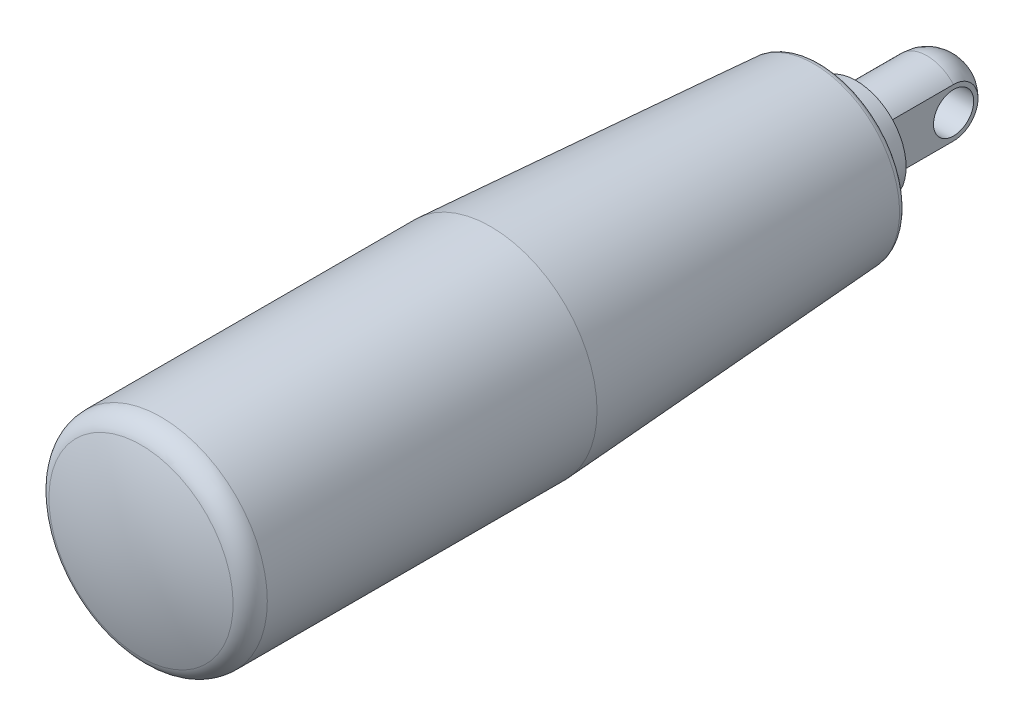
ISO-10303-21;
HEADER;
FILE_DESCRIPTION(('STEP AP214'),'2;1');
FILE_NAME('part.step','',(''),(''),'','','');
FILE_SCHEMA(('AUTOMOTIVE_DESIGN { 1 0 10303 214 1 1 1 1 }'));
ENDSEC;
DATA;
#1=APPLICATION_CONTEXT('core data for automotive mechanical design processes');
#2=APPLICATION_PROTOCOL_DEFINITION('international standard','automotive_design',2000,#1);
#3=PRODUCT_CONTEXT('',#1,'mechanical');
#4=PRODUCT('Part','Part','',(#3));
#5=PRODUCT_RELATED_PRODUCT_CATEGORY('part','',(#4));
#6=PRODUCT_DEFINITION_FORMATION('','',#4);
#7=PRODUCT_DEFINITION_CONTEXT('part definition',#1,'design');
#8=PRODUCT_DEFINITION('design','',#6,#7);
#9=PRODUCT_DEFINITION_SHAPE('','',#8);
#10=(LENGTH_UNIT() NAMED_UNIT(*) SI_UNIT(.MILLI.,.METRE.));
#11=(NAMED_UNIT(*) PLANE_ANGLE_UNIT() SI_UNIT($,.RADIAN.));
#12=(NAMED_UNIT(*) SI_UNIT($,.STERADIAN.) SOLID_ANGLE_UNIT());
#13=UNCERTAINTY_MEASURE_WITH_UNIT(LENGTH_MEASURE(1.E-05),#10,'distance_accuracy_value','');
#14=(GEOMETRIC_REPRESENTATION_CONTEXT(3) GLOBAL_UNCERTAINTY_ASSIGNED_CONTEXT((#13)) GLOBAL_UNIT_ASSIGNED_CONTEXT((#10,
#11,#12)) REPRESENTATION_CONTEXT('',''));
#15=CARTESIAN_POINT('',(0.,0.,0.));
#16=DIRECTION('',(0.,0.,1.));
#17=DIRECTION('',(1.,0.,0.));
#18=AXIS2_PLACEMENT_3D('',#15,#16,#17);
#19=CARTESIAN_POINT('',(26.,0.,0.));
#20=DIRECTION('',(1.,0.,0.));
#21=DIRECTION('',(0.,1.,0.));
#22=AXIS2_PLACEMENT_3D('',#19,#20,#21);
#23=CYLINDRICAL_SURFACE('',#22,2.6);
#24=CARTESIAN_POINT('',(-3.4375,0.,0.));
#25=DIRECTION('',(1.,0.,0.));
#26=DIRECTION('',(0.,1.,0.));
#27=AXIS2_PLACEMENT_3D('',#24,#25,#26);
#28=CIRCLE('',#27,2.6);
#29=CARTESIAN_POINT('',(-3.4375,2.6,0.));
#30=VERTEX_POINT('',#29);
#31=EDGE_CURVE('E86',#30,#30,#28,.F.);
#32=ORIENTED_EDGE('',*,*,#31,.T.);
#33=EDGE_LOOP('',(#32));
#34=FACE_BOUND('',#33,.T.);
#35=CARTESIAN_POINT('',(3.4375,0.,0.));
#36=DIRECTION('',(1.,0.,0.));
#37=DIRECTION('',(0.,1.,0.));
#38=AXIS2_PLACEMENT_3D('',#35,#36,#37);
#39=CIRCLE('',#38,2.6);
#40=CARTESIAN_POINT('',(3.4375,2.6,0.));
#41=VERTEX_POINT('',#40);
#42=EDGE_CURVE('E19',#41,#41,#39,.F.);
#43=ORIENTED_EDGE('',*,*,#42,.F.);
#44=EDGE_LOOP('',(#43));
#45=FACE_BOUND('',#44,.T.);
#46=ADVANCED_FACE('F14',(#34,#45),#23,.F.);
#47=CARTESIAN_POINT('',(0.0100000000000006,0.,0.00999999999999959));
#48=DIRECTION('',(0.,-1.,0.));
#49=DIRECTION('',(1.,0.,0.));
#50=AXIS2_PLACEMENT_3D('',#47,#48,#49);
#51=CIRCLE('',#50,4.665);
#52=TRIMMED_CURVE('',#51,(PARAMETER_VALUE(-1.572939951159)),(PARAMETER_VALUE(1.572939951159)),
.T.,.PARAMETER.);
#53=CARTESIAN_POINT('',(0.,0.,0.00999999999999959));
#54=DIRECTION('',(0.,0.,1.));
#55=AXIS1_PLACEMENT('',#53,#54);
#56=SURFACE_OF_REVOLUTION('',#52,#55);
#57=CARTESIAN_POINT('',(0.,0.,-4.65498928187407));
#58=VERTEX_POINT('',#57);
#59=VERTEX_LOOP('',#58);
#60=FACE_BOUND('',#59,.T.);
#61=CARTESIAN_POINT('',(0.,0.,0.00999999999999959));
#62=DIRECTION('',(0.,0.,-1.));
#63=DIRECTION('',(0.,1.,0.));
#64=AXIS2_PLACEMENT_3D('',#61,#62,#63);
#65=CIRCLE('',#64,4.675);
#66=CARTESIAN_POINT('',(3.4375,3.1684726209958,0.00999999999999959));
#67=VERTEX_POINT('',#66);
#68=CARTESIAN_POINT('',(-3.4375,3.1684726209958,0.00999999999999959));
#69=VERTEX_POINT('',#68);
#70=EDGE_CURVE('E64',#67,#69,#65,.F.);
#71=ORIENTED_EDGE('',*,*,#70,.F.);
#72=CARTESIAN_POINT('',(3.4375,-3.1684726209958,0.00999999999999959));
#73=CARTESIAN_POINT('',(3.4375,-3.16847205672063,-0.0789879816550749));
#74=CARTESIAN_POINT('',(3.4375,-3.16471332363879,-0.167933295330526));
#75=CARTESIAN_POINT('',(3.4375,-3.14971841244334,-0.345186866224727));
#76=CARTESIAN_POINT('',(3.4375,-3.13848260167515,-0.433495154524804));
#77=CARTESIAN_POINT('',(3.4375,-3.09366567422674,-0.696366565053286));
#78=CARTESIAN_POINT('',(3.4375,-3.04897477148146,-0.869167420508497));
#79=CARTESIAN_POINT('',(3.4375,-2.93121313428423,-1.20480179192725));
#80=CARTESIAN_POINT('',(3.4375,-2.85812938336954,-1.36763069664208));
#81=CARTESIAN_POINT('',(3.4375,-2.68567390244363,-1.6787008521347));
#82=CARTESIAN_POINT('',(3.4375,-2.58630725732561,-1.8269449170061));
#83=CARTESIAN_POINT('',(3.4375,-2.36410034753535,-2.10466404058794));
#84=CARTESIAN_POINT('',(3.4375,-2.24125795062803,-2.23413739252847));
#85=CARTESIAN_POINT('',(3.4375,-1.97557835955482,-2.47066675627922));
#86=CARTESIAN_POINT('',(3.4375,-1.83273807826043,-2.57771930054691));
#87=CARTESIAN_POINT('',(3.4375,-1.53100283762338,-2.76644637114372));
#88=CARTESIAN_POINT('',(3.4375,-1.37209402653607,-2.84809875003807));
#89=CARTESIAN_POINT('',(3.4375,-1.04284700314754,-2.98360246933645));
#90=CARTESIAN_POINT('',(3.4375,-0.872509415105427,-3.03745532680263));
#91=CARTESIAN_POINT('',(3.4375,-0.524979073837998,-3.11591691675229));
#92=CARTESIAN_POINT('',(3.4375,-0.347777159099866,-3.1404850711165));
#93=CARTESIAN_POINT('',(3.4375,0.00824193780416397,-3.15955654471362));
#94=CARTESIAN_POINT('',(3.4375,0.187059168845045,-3.15405895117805));
#95=CARTESIAN_POINT('',(3.4375,0.541412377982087,-3.11312990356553));
#96=CARTESIAN_POINT('',(3.4375,0.716944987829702,-3.07766927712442));
#97=CARTESIAN_POINT('',(3.4375,1.05955995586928,-2.97776798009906));
#98=CARTESIAN_POINT('',(3.4375,1.22664236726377,-2.91332749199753));
#99=CARTESIAN_POINT('',(3.4375,1.5475261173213,-2.75731471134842));
#100=CARTESIAN_POINT('',(3.4375,1.70133348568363,-2.66575482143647));
#101=CARTESIAN_POINT('',(3.4375,1.99135770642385,-2.45808271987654));
#102=CARTESIAN_POINT('',(3.4375,2.12757553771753,-2.34197187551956));
#103=CARTESIAN_POINT('',(3.4375,2.37834859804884,-2.08868247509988));
#104=CARTESIAN_POINT('',(3.4375,2.49293603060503,-1.9515357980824));
#105=CARTESIAN_POINT('',(3.4375,2.69746535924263,-1.65987987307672));
#106=CARTESIAN_POINT('',(3.4375,2.78739953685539,-1.50536520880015));
#107=CARTESIAN_POINT('',(3.4375,2.93996371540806,-1.18352917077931));
#108=CARTESIAN_POINT('',(3.4375,3.00260765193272,-1.01621438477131));
#109=CARTESIAN_POINT('',(3.4375,3.09880144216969,-0.673569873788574));
#110=CARTESIAN_POINT('',(3.4375,3.13239594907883,-0.498252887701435));
#111=CARTESIAN_POINT('',(3.4375,3.15685169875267,-0.266476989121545));
#112=CARTESIAN_POINT('',(3.4375,3.1612118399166,-0.211222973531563));
#113=CARTESIAN_POINT('',(3.4375,3.1670183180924,-0.100653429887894));
#114=CARTESIAN_POINT('',(3.4375,3.16846945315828,-0.0453381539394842));
#115=CARTESIAN_POINT('',(3.4375,3.1684726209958,0.00999999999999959));
#116=B_SPLINE_CURVE_WITH_KNOTS('',3,(#72,#73,#74,#75,#76,#77,#78,#79,#80,#81,#82,#83,#84,#85,
#86,#87,#88,#89,#90,#91,#92,#93,#94,#95,#96,#97,#98,#99,#100,#101,#102,#103,#104,#105,#106,#107,
#108,#109,#110,#111,#112,#113,#114,#115),.UNSPECIFIED.,.F.,.F.,(4,2,2,2,2,2,2,2,2,2,2,2,2,2,2,2,
2,2,2,2,2,4),(0.,0.266799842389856,0.533586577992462,1.06629761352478,1.59925315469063,
2.13210566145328,2.66500658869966,3.19798987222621,3.73143659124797,4.26485419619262,
4.79901007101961,5.3331821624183,5.8678749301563,6.40256433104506,6.93700957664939,
7.47142506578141,8.00503852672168,8.53881886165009,9.07232630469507,9.60501220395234,
9.77123628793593,9.93718597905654),.UNSPECIFIED.);
#117=CARTESIAN_POINT('',(3.4375,-3.1684726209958,0.00999999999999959));
#118=VERTEX_POINT('',#117);
#119=EDGE_CURVE('E57',#118,#67,#116,.T.);
#120=ORIENTED_EDGE('',*,*,#119,.F.);
#121=CARTESIAN_POINT('',(0.,0.,0.00999999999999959));
#122=DIRECTION('',(0.,0.,-1.));
#123=DIRECTION('',(0.,1.,0.));
#124=AXIS2_PLACEMENT_3D('',#121,#122,#123);
#125=CIRCLE('',#124,4.675);
#126=CARTESIAN_POINT('',(-3.4375,-3.1684726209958,0.00999999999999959));
#127=VERTEX_POINT('',#126);
#128=EDGE_CURVE('E89',#127,#118,#125,.F.);
#129=ORIENTED_EDGE('',*,*,#128,.F.);
#130=CARTESIAN_POINT('',(-3.4375,-3.1684726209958,0.00999999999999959));
#131=CARTESIAN_POINT('',(-3.4375,-3.16847205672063,-0.078987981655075));
#132=CARTESIAN_POINT('',(-3.4375,-3.16471332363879,-0.167933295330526));
#133=CARTESIAN_POINT('',(-3.4375,-3.14971841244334,-0.345186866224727));
#134=CARTESIAN_POINT('',(-3.4375,-3.13848260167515,-0.433495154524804));
#135=CARTESIAN_POINT('',(-3.4375,-3.09366567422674,-0.696366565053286));
#136=CARTESIAN_POINT('',(-3.4375,-3.04897477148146,-0.869167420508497));
#137=CARTESIAN_POINT('',(-3.4375,-2.93121313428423,-1.20480179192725));
#138=CARTESIAN_POINT('',(-3.4375,-2.85812938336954,-1.36763069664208));
#139=CARTESIAN_POINT('',(-3.4375,-2.68567390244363,-1.6787008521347));
#140=CARTESIAN_POINT('',(-3.4375,-2.58630725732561,-1.8269449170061));
#141=CARTESIAN_POINT('',(-3.4375,-2.36410034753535,-2.10466404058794));
#142=CARTESIAN_POINT('',(-3.4375,-2.24125795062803,-2.23413739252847));
#143=CARTESIAN_POINT('',(-3.4375,-1.97557835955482,-2.47066675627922));
#144=CARTESIAN_POINT('',(-3.4375,-1.83273807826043,-2.57771930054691));
#145=CARTESIAN_POINT('',(-3.4375,-1.53100283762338,-2.76644637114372));
#146=CARTESIAN_POINT('',(-3.4375,-1.37209402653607,-2.84809875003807));
#147=CARTESIAN_POINT('',(-3.4375,-1.04284700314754,-2.98360246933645));
#148=CARTESIAN_POINT('',(-3.4375,-0.872509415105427,-3.03745532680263));
#149=CARTESIAN_POINT('',(-3.4375,-0.524979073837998,-3.11591691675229));
#150=CARTESIAN_POINT('',(-3.4375,-0.347777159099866,-3.1404850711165));
#151=CARTESIAN_POINT('',(-3.4375,0.00824193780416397,-3.15955654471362));
#152=CARTESIAN_POINT('',(-3.4375,0.187059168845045,-3.15405895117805));
#153=CARTESIAN_POINT('',(-3.4375,0.541412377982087,-3.11312990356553));
#154=CARTESIAN_POINT('',(-3.4375,0.716944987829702,-3.07766927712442));
#155=CARTESIAN_POINT('',(-3.4375,1.05955995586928,-2.97776798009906));
#156=CARTESIAN_POINT('',(-3.4375,1.22664236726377,-2.91332749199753));
#157=CARTESIAN_POINT('',(-3.4375,1.5475261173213,-2.75731471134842));
#158=CARTESIAN_POINT('',(-3.4375,1.70133348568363,-2.66575482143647));
#159=CARTESIAN_POINT('',(-3.4375,1.99135770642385,-2.45808271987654));
#160=CARTESIAN_POINT('',(-3.4375,2.12757553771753,-2.34197187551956));
#161=CARTESIAN_POINT('',(-3.4375,2.37834859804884,-2.08868247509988));
#162=CARTESIAN_POINT('',(-3.4375,2.49293603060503,-1.9515357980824));
#163=CARTESIAN_POINT('',(-3.4375,2.69746535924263,-1.65987987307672));
#164=CARTESIAN_POINT('',(-3.4375,2.78739953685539,-1.50536520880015));
#165=CARTESIAN_POINT('',(-3.4375,2.93996371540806,-1.18352917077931));
#166=CARTESIAN_POINT('',(-3.4375,3.00260765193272,-1.01621438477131));
#167=CARTESIAN_POINT('',(-3.4375,3.09880144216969,-0.673569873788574));
#168=CARTESIAN_POINT('',(-3.4375,3.13239594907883,-0.498252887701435));
#169=CARTESIAN_POINT('',(-3.4375,3.15685169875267,-0.266476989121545));
#170=CARTESIAN_POINT('',(-3.4375,3.1612118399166,-0.211222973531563));
#171=CARTESIAN_POINT('',(-3.4375,3.1670183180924,-0.100653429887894));
#172=CARTESIAN_POINT('',(-3.4375,3.16846945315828,-0.0453381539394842));
#173=CARTESIAN_POINT('',(-3.4375,3.1684726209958,0.00999999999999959));
#174=B_SPLINE_CURVE_WITH_KNOTS('',3,(#130,#131,#132,#133,#134,#135,#136,#137,#138,#139,#140,
#141,#142,#143,#144,#145,#146,#147,#148,#149,#150,#151,#152,#153,#154,#155,#156,#157,#158,#159,
#160,#161,#162,#163,#164,#165,#166,#167,#168,#169,#170,#171,#172,#173),.UNSPECIFIED.,.F.,.F.,(4,
2,2,2,2,2,2,2,2,2,2,2,2,2,2,2,2,2,2,2,2,4),(0.,0.266799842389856,0.533586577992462,
1.06629761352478,1.59925315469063,2.13210566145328,2.66500658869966,3.19798987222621,
3.73143659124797,4.26485419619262,4.79901007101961,5.3331821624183,5.8678749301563,
6.40256433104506,6.93700957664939,7.47142506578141,8.00503852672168,8.53881886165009,
9.07232630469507,9.60501220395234,9.77123628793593,9.93718597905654),.UNSPECIFIED.);
#175=EDGE_CURVE('E67',#127,#69,#174,.T.);
#176=ORIENTED_EDGE('',*,*,#175,.T.);
#177=EDGE_LOOP('',(#71,#120,#129,#176));
#178=FACE_BOUND('',#177,.T.);
#179=ADVANCED_FACE('F16',(#60,#178),#56,.T.);
#180=CARTESIAN_POINT('',(3.4375,0.,-9.25));
#181=DIRECTION('',(1.,0.,0.));
#182=DIRECTION('',(0.,1.,0.));
#183=AXIS2_PLACEMENT_3D('',#180,#181,#182);
#184=PLANE('',#183);
#185=DIRECTION('',(0.,0.,-1.));
#186=VECTOR('',#185,1.);
#187=CARTESIAN_POINT('',(3.4375,-3.1684726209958,-4.65498928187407));
#188=LINE('',#187,#186);
#189=CARTESIAN_POINT('',(3.4375,-3.1684726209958,9.15));
#190=VERTEX_POINT('',#189);
#191=EDGE_CURVE('E87',#118,#190,#188,.F.);
#192=ORIENTED_EDGE('',*,*,#191,.F.);
#193=ORIENTED_EDGE('',*,*,#119,.T.);
#194=DIRECTION('',(0.,0.,-1.));
#195=VECTOR('',#194,1.);
#196=CARTESIAN_POINT('',(3.4375,3.1684726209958,-4.65498928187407));
#197=LINE('',#196,#195);
#198=CARTESIAN_POINT('',(3.4375,3.1684726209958,9.15));
#199=VERTEX_POINT('',#198);
#200=EDGE_CURVE('E70',#199,#67,#197,.T.);
#201=ORIENTED_EDGE('',*,*,#200,.F.);
#202=DIRECTION('',(0.,-1.,0.));
#203=VECTOR('',#202,1.);
#204=CARTESIAN_POINT('',(3.4375,0.,9.15));
#205=LINE('',#204,#203);
#206=EDGE_CURVE('E69',#199,#190,#205,.T.);
#207=ORIENTED_EDGE('',*,*,#206,.T.);
#208=EDGE_LOOP('',(#192,#193,#201,#207));
#209=FACE_BOUND('',#208,.T.);
#210=ORIENTED_EDGE('',*,*,#42,.T.);
#211=EDGE_LOOP('',(#210));
#212=FACE_BOUND('',#211,.T.);
#213=ADVANCED_FACE('F62',(#209,#212),#184,.T.);
#214=CARTESIAN_POINT('',(0.,0.,-4.65498928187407));
#215=DIRECTION('',(0.,0.,-1.));
#216=DIRECTION('',(0.,1.,0.));
#217=AXIS2_PLACEMENT_3D('',#214,#215,#216);
#218=CYLINDRICAL_SURFACE('',#217,4.675);
#219=ORIENTED_EDGE('',*,*,#128,.T.);
#220=ORIENTED_EDGE('',*,*,#191,.T.);
#221=CARTESIAN_POINT('',(0.,0.,9.15));
#222=DIRECTION('',(0.,0.,-1.));
#223=DIRECTION('',(0.,1.,0.));
#224=AXIS2_PLACEMENT_3D('',#221,#222,#223);
#225=CIRCLE('',#224,4.675);
#226=CARTESIAN_POINT('',(-3.4375,-3.1684726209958,9.15));
#227=VERTEX_POINT('',#226);
#228=EDGE_CURVE('E111',#190,#227,#225,.T.);
#229=ORIENTED_EDGE('',*,*,#228,.T.);
#230=DIRECTION('',(0.,0.,1.));
#231=VECTOR('',#230,1.);
#232=CARTESIAN_POINT('',(-3.4375,-3.1684726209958,-9.25));
#233=LINE('',#232,#231);
#234=EDGE_CURVE('E83',#227,#127,#233,.F.);
#235=ORIENTED_EDGE('',*,*,#234,.T.);
#236=EDGE_LOOP('',(#219,#220,#229,#235));
#237=FACE_BOUND('',#236,.T.);
#238=ADVANCED_FACE('F124',(#237),#218,.T.);
#239=CARTESIAN_POINT('',(-3.4375,0.,-9.25));
#240=DIRECTION('',(1.,0.,0.));
#241=DIRECTION('',(0.,1.,0.));
#242=AXIS2_PLACEMENT_3D('',#239,#240,#241);
#243=PLANE('',#242);
#244=DIRECTION('',(0.,0.,-1.));
#245=VECTOR('',#244,1.);
#246=CARTESIAN_POINT('',(-3.4375,3.1684726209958,-4.65498928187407));
#247=LINE('',#246,#245);
#248=CARTESIAN_POINT('',(-3.4375,3.1684726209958,9.15));
#249=VERTEX_POINT('',#248);
#250=EDGE_CURVE('E78',#69,#249,#247,.F.);
#251=ORIENTED_EDGE('',*,*,#250,.F.);
#252=ORIENTED_EDGE('',*,*,#175,.F.);
#253=ORIENTED_EDGE('',*,*,#234,.F.);
#254=DIRECTION('',(0.,-1.,0.));
#255=VECTOR('',#254,1.);
#256=CARTESIAN_POINT('',(-3.4375,0.,9.15));
#257=LINE('',#256,#255);
#258=EDGE_CURVE('E34',#227,#249,#257,.F.);
#259=ORIENTED_EDGE('',*,*,#258,.T.);
#260=EDGE_LOOP('',(#251,#252,#253,#259));
#261=FACE_BOUND('',#260,.T.);
#262=ORIENTED_EDGE('',*,*,#31,.F.);
#263=EDGE_LOOP('',(#262));
#264=FACE_BOUND('',#263,.T.);
#265=ADVANCED_FACE('F119',(#261,#264),#243,.F.);
#266=CARTESIAN_POINT('',(0.,0.,-4.65498928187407));
#267=DIRECTION('',(0.,0.,-1.));
#268=DIRECTION('',(0.,1.,0.));
#269=AXIS2_PLACEMENT_3D('',#266,#267,#268);
#270=CYLINDRICAL_SURFACE('',#269,4.675);
#271=ORIENTED_EDGE('',*,*,#200,.T.);
#272=ORIENTED_EDGE('',*,*,#70,.T.);
#273=ORIENTED_EDGE('',*,*,#250,.T.);
#274=CARTESIAN_POINT('',(0.,0.,9.15));
#275=DIRECTION('',(0.,0.,-1.));
#276=DIRECTION('',(0.,1.,0.));
#277=AXIS2_PLACEMENT_3D('',#274,#275,#276);
#278=CIRCLE('',#277,4.675);
#279=EDGE_CURVE('E75',#249,#199,#278,.T.);
#280=ORIENTED_EDGE('',*,*,#279,.T.);
#281=EDGE_LOOP('',(#271,#272,#273,#280));
#282=FACE_BOUND('',#281,.T.);
#283=ADVANCED_FACE('F73',(#282),#270,.T.);
#284=CARTESIAN_POINT('',(0.,0.,9.15));
#285=DIRECTION('',(0.,0.,1.));
#286=DIRECTION('',(0.,-1.,0.));
#287=AXIS2_PLACEMENT_3D('',#284,#285,#286);
#288=PLANE('',#287);
#289=ORIENTED_EDGE('',*,*,#258,.F.);
#290=ORIENTED_EDGE('',*,*,#228,.F.);
#291=ORIENTED_EDGE('',*,*,#206,.F.);
#292=ORIENTED_EDGE('',*,*,#279,.F.);
#293=EDGE_LOOP('',(#289,#290,#291,#292));
#294=FACE_BOUND('',#293,.T.);
#295=CARTESIAN_POINT('',(0.,0.,9.14999999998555));
#296=DIRECTION('',(0.,0.,1.));
#297=DIRECTION('',(1.,0.,0.));
#298=AXIS2_PLACEMENT_3D('',#295,#296,#297);
#299=CIRCLE('',#298,6.44407263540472);
#300=CARTESIAN_POINT('',(6.44407263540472,0.,9.14999999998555));
#301=VERTEX_POINT('',#300);
#302=EDGE_CURVE('E107',#301,#301,#299,.T.);
#303=ORIENTED_EDGE('',*,*,#302,.F.);
#304=EDGE_LOOP('',(#303));
#305=FACE_BOUND('',#304,.T.);
#306=ADVANCED_FACE('F210',(#294,#305),#288,.F.);
#307=CARTESIAN_POINT('',(0.,0.,13.2499999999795));
#308=DIRECTION('',(0.,0.,1.));
#309=DIRECTION('',(1.,0.,0.));
#310=AXIS2_PLACEMENT_3D('',#307,#308,#309);
#311=CONICAL_SURFACE('',#310,6.87500000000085,0.104719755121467);
#312=ORIENTED_EDGE('',*,*,#302,.T.);
#313=EDGE_LOOP('',(#312));
#314=FACE_BOUND('',#313,.T.);
#315=CARTESIAN_POINT('',(0.,0.,13.2499999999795));
#316=DIRECTION('',(0.,0.,1.));
#317=DIRECTION('',(1.,0.,0.));
#318=AXIS2_PLACEMENT_3D('',#315,#316,#317);
#319=CIRCLE('',#318,6.87500000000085);
#320=CARTESIAN_POINT('',(6.87500000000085,0.,13.2499999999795));
#321=VERTEX_POINT('',#320);
#322=EDGE_CURVE('E104',#321,#321,#319,.F.);
#323=ORIENTED_EDGE('',*,*,#322,.T.);
#324=EDGE_LOOP('',(#323));
#325=FACE_BOUND('',#324,.T.);
#326=ADVANCED_FACE('F213',(#314,#325),#311,.T.);
#327=CARTESIAN_POINT('',(0.,-6.875,13.25));
#328=DIRECTION('',(0.,0.,1.));
#329=DIRECTION('',(0.,-1.,0.));
#330=AXIS2_PLACEMENT_3D('',#327,#328,#329);
#331=PLANE('',#330);
#332=ORIENTED_EDGE('',*,*,#322,.F.);
#333=EDGE_LOOP('',(#332));
#334=FACE_BOUND('',#333,.T.);
#335=CARTESIAN_POINT('',(0.,0.,13.25));
#336=DIRECTION('',(0.,0.,-1.));
#337=DIRECTION('',(0.,1.,0.));
#338=AXIS2_PLACEMENT_3D('',#335,#336,#337);
#339=CIRCLE('',#338,9.625);
#340=CARTESIAN_POINT('',(0.,9.625,13.25));
#341=VERTEX_POINT('',#340);
#342=EDGE_CURVE('E101',#341,#341,#339,.F.);
#343=ORIENTED_EDGE('',*,*,#342,.F.);
#344=EDGE_LOOP('',(#343));
#345=FACE_BOUND('',#344,.T.);
#346=ADVANCED_FACE('F218',(#334,#345),#331,.F.);
#347=CARTESIAN_POINT('',(0.,0.,103.75));
#348=DIRECTION('',(0.,0.,-1.));
#349=DIRECTION('',(0.,1.,0.));
#350=AXIS2_PLACEMENT_3D('',#347,#348,#349);
#351=CYLINDRICAL_SURFACE('',#350,9.625);
#352=ORIENTED_EDGE('',*,*,#342,.T.);
#353=EDGE_LOOP('',(#352));
#354=FACE_BOUND('',#353,.T.);
#355=CARTESIAN_POINT('',(0.,0.,13.75));
#356=DIRECTION('',(0.,0.,-1.));
#357=DIRECTION('',(0.,1.,0.));
#358=AXIS2_PLACEMENT_3D('',#355,#356,#357);
#359=CIRCLE('',#358,9.625);
#360=CARTESIAN_POINT('',(0.,9.625,13.75));
#361=VERTEX_POINT('',#360);
#362=EDGE_CURVE('E98',#361,#361,#359,.T.);
#363=ORIENTED_EDGE('',*,*,#362,.T.);
#364=EDGE_LOOP('',(#363));
#365=FACE_BOUND('',#364,.T.);
#366=ADVANCED_FACE('F186',(#354,#365),#351,.T.);
#367=CARTESIAN_POINT('',(0.,-9.625,13.75));
#368=DIRECTION('',(0.,0.,1.));
#369=DIRECTION('',(0.,-1.,0.));
#370=AXIS2_PLACEMENT_3D('',#367,#368,#369);
#371=PLANE('',#370);
#372=ORIENTED_EDGE('',*,*,#362,.F.);
#373=EDGE_LOOP('',(#372));
#374=FACE_BOUND('',#373,.T.);
#375=CARTESIAN_POINT('',(0.,0.,13.75));
#376=DIRECTION('',(0.,0.,1.));
#377=DIRECTION('',(0.,-1.,0.));
#378=AXIS2_PLACEMENT_3D('',#375,#376,#377);
#379=CIRCLE('',#378,10.1404701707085);
#380=CARTESIAN_POINT('',(0.,-10.1404701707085,13.75));
#381=VERTEX_POINT('',#380);
#382=EDGE_CURVE('E97',#381,#381,#379,.T.);
#383=ORIENTED_EDGE('',*,*,#382,.F.);
#384=EDGE_LOOP('',(#383));
#385=FACE_BOUND('',#384,.T.);
#386=ADVANCED_FACE('F181',(#374,#385),#371,.F.);
#387=CARTESIAN_POINT('',(0.,1.00710636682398E-13,68.));
#388=DIRECTION('',(0.,-1.,0.));
#389=DIRECTION('',(1.,0.,0.));
#390=AXIS2_PLACEMENT_3D('',#387,#388,#389);
#391=SPHERICAL_SURFACE('',#390,35.75);
#392=CARTESIAN_POINT('',(0.,0.,101.705423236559));
#393=DIRECTION('',(0.,0.,1.));
#394=DIRECTION('',(0.,-1.,0.));
#395=AXIS2_PLACEMENT_3D('',#392,#393,#394);
#396=CIRCLE('',#395,11.9166666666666);
#397=CARTESIAN_POINT('',(0.,-11.9166666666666,101.705423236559));
#398=VERTEX_POINT('',#397);
#399=EDGE_CURVE('E93',#398,#398,#396,.F.);
#400=ORIENTED_EDGE('',*,*,#399,.F.);
#401=EDGE_LOOP('',(#400));
#402=FACE_BOUND('',#401,.T.);
#403=ADVANCED_FACE('F178',(#402),#391,.T.);
#404=CARTESIAN_POINT('',(0.,0.,14.6666666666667));
#405=DIRECTION('',(0.,0.,1.));
#406=DIRECTION('',(0.,-1.,0.));
#407=AXIS2_PLACEMENT_3D('',#404,#405,#406);
#408=TOROIDAL_SURFACE('',#407,10.1404701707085,0.916666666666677);
#409=CARTESIAN_POINT('',(0.,0.,14.6077528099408));
#410=DIRECTION('',(0.,0.,1.));
#411=DIRECTION('',(0.,-1.,0.));
#412=AXIS2_PLACEMENT_3D('',#409,#410,#411);
#413=CIRCLE('',#412,11.0552416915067);
#414=CARTESIAN_POINT('',(0.,-11.0552416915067,14.6077528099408));
#415=VERTEX_POINT('',#414);
#416=EDGE_CURVE('E96',#415,#415,#413,.T.);
#417=ORIENTED_EDGE('',*,*,#416,.F.);
#418=EDGE_LOOP('',(#417));
#419=FACE_BOUND('',#418,.T.);
#420=ORIENTED_EDGE('',*,*,#382,.T.);
#421=EDGE_LOOP('',(#420));
#422=FACE_BOUND('',#421,.T.);
#423=ADVANCED_FACE('F163',(#419,#422),#408,.T.);
#424=CARTESIAN_POINT('',(0.,0.,99.112698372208));
#425=DIRECTION('',(0.,0.,1.));
#426=DIRECTION('',(0.,-1.,0.));
#427=AXIS2_PLACEMENT_3D('',#424,#425,#426);
#428=TOROIDAL_SURFACE('',#427,11.,2.75000000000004);
#429=ORIENTED_EDGE('',*,*,#399,.T.);
#430=EDGE_LOOP('',(#429));
#431=FACE_BOUND('',#430,.T.);
#432=CARTESIAN_POINT('',(0.,0.,99.112698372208));
#433=DIRECTION('',(0.,0.,-1.));
#434=DIRECTION('',(0.,1.,0.));
#435=AXIS2_PLACEMENT_3D('',#432,#433,#434);
#436=CIRCLE('',#435,13.75);
#437=CARTESIAN_POINT('',(0.,13.75,99.112698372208));
#438=VERTEX_POINT('',#437);
#439=EDGE_CURVE('E25',#438,#438,#436,.T.);
#440=ORIENTED_EDGE('',*,*,#439,.F.);
#441=EDGE_LOOP('',(#440));
#442=FACE_BOUND('',#441,.T.);
#443=ADVANCED_FACE('F155',(#431,#442),#428,.T.);
#444=CARTESIAN_POINT('',(0.,0.,56.45));
#445=DIRECTION('',(0.,0.,1.));
#446=DIRECTION('',(1.,0.,0.));
#447=AXIS2_PLACEMENT_3D('',#444,#445,#446);
#448=CONICAL_SURFACE('',#447,13.75,0.0643139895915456);
#449=ORIENTED_EDGE('',*,*,#416,.T.);
#450=EDGE_LOOP('',(#449));
#451=FACE_BOUND('',#450,.T.);
#452=CARTESIAN_POINT('',(0.,0.,56.45));
#453=DIRECTION('',(0.,0.,-1.));
#454=DIRECTION('',(0.,1.,0.));
#455=AXIS2_PLACEMENT_3D('',#452,#453,#454);
#456=CIRCLE('',#455,13.75);
#457=CARTESIAN_POINT('',(0.,13.75,56.45));
#458=VERTEX_POINT('',#457);
#459=EDGE_CURVE('E9',#458,#458,#456,.F.);
#460=ORIENTED_EDGE('',*,*,#459,.F.);
#461=EDGE_LOOP('',(#460));
#462=FACE_BOUND('',#461,.T.);
#463=ADVANCED_FACE('F148',(#451,#462),#448,.T.);
#464=CARTESIAN_POINT('',(0.,0.,103.75));
#465=DIRECTION('',(0.,0.,-1.));
#466=DIRECTION('',(0.,1.,0.));
#467=AXIS2_PLACEMENT_3D('',#464,#465,#466);
#468=CYLINDRICAL_SURFACE('',#467,13.75);
#469=ORIENTED_EDGE('',*,*,#459,.T.);
#470=EDGE_LOOP('',(#469));
#471=FACE_BOUND('',#470,.T.);
#472=ORIENTED_EDGE('',*,*,#439,.T.);
#473=EDGE_LOOP('',(#472));
#474=FACE_BOUND('',#473,.T.);
#475=ADVANCED_FACE('F146',(#471,#474),#468,.T.);
#476=CLOSED_SHELL('',(#46,#179,#213,#238,#265,#283,#306,#326,#346,#366,#386,#403,#423,#443,#463,#475));
#477=MANIFOLD_SOLID_BREP('B1',#476);
#478=ADVANCED_BREP_SHAPE_REPRESENTATION('',(#18,#477),#14);
#479=SHAPE_DEFINITION_REPRESENTATION(#9,#478);
ENDSEC;
END-ISO-10303-21;
